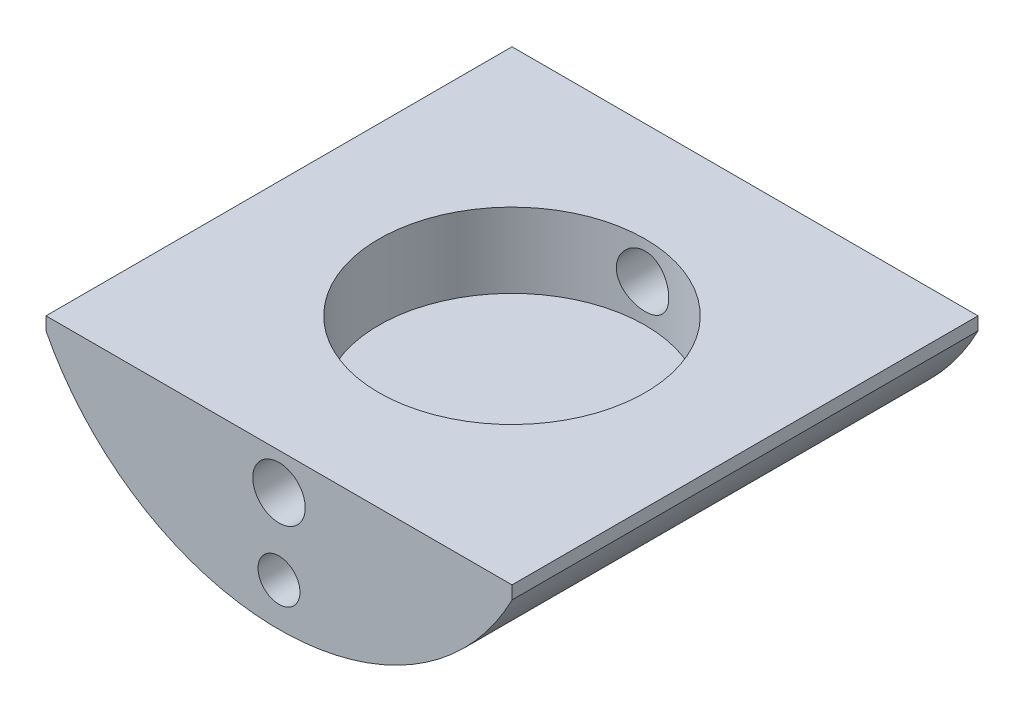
ISO-10303-21;
HEADER;
FILE_DESCRIPTION(('STEP AP214'),'2;1');
FILE_NAME('part.step','',(''),(''),'','','');
FILE_SCHEMA(('AUTOMOTIVE_DESIGN { 1 0 10303 214 1 1 1 1 }'));
ENDSEC;
DATA;
#1=APPLICATION_CONTEXT('core data for automotive mechanical design processes');
#2=APPLICATION_PROTOCOL_DEFINITION('international standard','automotive_design',2000,#1);
#3=PRODUCT_CONTEXT('',#1,'mechanical');
#4=PRODUCT('Part','Part','',(#3));
#5=PRODUCT_RELATED_PRODUCT_CATEGORY('part','',(#4));
#6=PRODUCT_DEFINITION_FORMATION('','',#4);
#7=PRODUCT_DEFINITION_CONTEXT('part definition',#1,'design');
#8=PRODUCT_DEFINITION('design','',#6,#7);
#9=PRODUCT_DEFINITION_SHAPE('','',#8);
#10=(LENGTH_UNIT() NAMED_UNIT(*) SI_UNIT(.MILLI.,.METRE.));
#11=(NAMED_UNIT(*) PLANE_ANGLE_UNIT() SI_UNIT($,.RADIAN.));
#12=(NAMED_UNIT(*) SI_UNIT($,.STERADIAN.) SOLID_ANGLE_UNIT());
#13=UNCERTAINTY_MEASURE_WITH_UNIT(LENGTH_MEASURE(1.E-05),#10,'distance_accuracy_value','');
#14=(GEOMETRIC_REPRESENTATION_CONTEXT(3) GLOBAL_UNCERTAINTY_ASSIGNED_CONTEXT((#13)) GLOBAL_UNIT_ASSIGNED_CONTEXT((#10,
#11,#12)) REPRESENTATION_CONTEXT('',''));
#15=CARTESIAN_POINT('',(0.,0.,0.));
#16=DIRECTION('',(0.,0.,1.));
#17=DIRECTION('',(1.,0.,0.));
#18=AXIS2_PLACEMENT_3D('',#15,#16,#17);
#19=CARTESIAN_POINT('',(0.,20.395359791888,44.45));
#20=DIRECTION('',(0.,0.,-1.));
#21=DIRECTION('',(-1.,0.,0.));
#22=AXIS2_PLACEMENT_3D('',#19,#20,#21);
#23=CYLINDRICAL_SURFACE('',#22,50.);
#24=CARTESIAN_POINT('',(0.,20.395359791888,-44.45));
#25=DIRECTION('',(0.,0.,1.));
#26=DIRECTION('',(1.,0.,0.));
#27=AXIS2_PLACEMENT_3D('',#24,#25,#26);
#28=CIRCLE('',#27,50.);
#29=CARTESIAN_POINT('',(-44.45,-2.5,-44.45));
#30=VERTEX_POINT('',#29);
#31=CARTESIAN_POINT('',(44.45,-2.5,-44.45));
#32=VERTEX_POINT('',#31);
#33=EDGE_CURVE('E116',#30,#32,#28,.T.);
#34=ORIENTED_EDGE('',*,*,#33,.T.);
#35=DIRECTION('',(0.,0.,-1.));
#36=VECTOR('',#35,1.);
#37=CARTESIAN_POINT('',(44.45,-2.5,44.45));
#38=LINE('',#37,#36);
#39=CARTESIAN_POINT('',(44.45,-2.5,44.45));
#40=VERTEX_POINT('',#39);
#41=EDGE_CURVE('E13',#40,#32,#38,.T.);
#42=ORIENTED_EDGE('',*,*,#41,.F.);
#43=CARTESIAN_POINT('',(0.,20.395359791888,44.45));
#44=DIRECTION('',(0.,0.,1.));
#45=DIRECTION('',(1.,0.,0.));
#46=AXIS2_PLACEMENT_3D('',#43,#44,#45);
#47=CIRCLE('',#46,50.);
#48=CARTESIAN_POINT('',(-44.45,-2.5,44.45));
#49=VERTEX_POINT('',#48);
#50=EDGE_CURVE('E103',#49,#40,#47,.T.);
#51=ORIENTED_EDGE('',*,*,#50,.F.);
#52=DIRECTION('',(0.,0.,-1.));
#53=VECTOR('',#52,1.);
#54=CARTESIAN_POINT('',(-44.45,-2.5,44.45));
#55=LINE('',#54,#53);
#56=EDGE_CURVE('E112',#49,#30,#55,.T.);
#57=ORIENTED_EDGE('',*,*,#56,.T.);
#58=EDGE_LOOP('',(#34,#42,#51,#57));
#59=FACE_BOUND('',#58,.T.);
#60=ADVANCED_FACE('F46',(#59),#23,.T.);
#61=CARTESIAN_POINT('',(44.45,0.,44.45));
#62=DIRECTION('',(-1.,0.,0.));
#63=DIRECTION('',(0.,-1.,0.));
#64=AXIS2_PLACEMENT_3D('',#61,#62,#63);
#65=PLANE('',#64);
#66=DIRECTION('',(0.,1.,0.));
#67=VECTOR('',#66,1.);
#68=CARTESIAN_POINT('',(44.45,0.,-44.45));
#69=LINE('',#68,#67);
#70=CARTESIAN_POINT('',(44.45,0.,-44.45));
#71=VERTEX_POINT('',#70);
#72=EDGE_CURVE('E107',#32,#71,#69,.T.);
#73=ORIENTED_EDGE('',*,*,#72,.T.);
#74=DIRECTION('',(0.,0.,-1.));
#75=VECTOR('',#74,1.);
#76=CARTESIAN_POINT('',(44.45,0.,44.45));
#77=LINE('',#76,#75);
#78=CARTESIAN_POINT('',(44.45,0.,44.45));
#79=VERTEX_POINT('',#78);
#80=EDGE_CURVE('E59',#79,#71,#77,.T.);
#81=ORIENTED_EDGE('',*,*,#80,.F.);
#82=DIRECTION('',(0.,1.,0.));
#83=VECTOR('',#82,1.);
#84=CARTESIAN_POINT('',(44.45,0.,44.45));
#85=LINE('',#84,#83);
#86=EDGE_CURVE('E98',#40,#79,#85,.T.);
#87=ORIENTED_EDGE('',*,*,#86,.F.);
#88=ORIENTED_EDGE('',*,*,#41,.T.);
#89=EDGE_LOOP('',(#73,#81,#87,#88));
#90=FACE_BOUND('',#89,.T.);
#91=ADVANCED_FACE('F106',(#90),#65,.F.);
#92=CARTESIAN_POINT('',(-44.45,0.,44.45));
#93=DIRECTION('',(0.,-1.,0.));
#94=DIRECTION('',(0.,0.,-1.));
#95=AXIS2_PLACEMENT_3D('',#92,#93,#94);
#96=PLANE('',#95);
#97=CARTESIAN_POINT('',(0.,0.,0.));
#98=DIRECTION('',(0.,1.,0.));
#99=DIRECTION('',(0.,0.,1.));
#100=AXIS2_PLACEMENT_3D('',#97,#98,#99);
#101=CIRCLE('',#100,25.4);
#102=CARTESIAN_POINT('',(0.,0.,25.4));
#103=VERTEX_POINT('',#102);
#104=EDGE_CURVE('E179',#103,#103,#101,.T.);
#105=ORIENTED_EDGE('',*,*,#104,.F.);
#106=EDGE_LOOP('',(#105));
#107=FACE_BOUND('',#106,.T.);
#108=DIRECTION('',(-1.,0.,0.));
#109=VECTOR('',#108,1.);
#110=CARTESIAN_POINT('',(-44.45,0.,-44.45));
#111=LINE('',#110,#109);
#112=CARTESIAN_POINT('',(-44.45,0.,-44.45));
#113=VERTEX_POINT('',#112);
#114=EDGE_CURVE('E85',#71,#113,#111,.T.);
#115=ORIENTED_EDGE('',*,*,#114,.T.);
#116=DIRECTION('',(0.,0.,-1.));
#117=VECTOR('',#116,1.);
#118=CARTESIAN_POINT('',(-44.45,0.,44.45));
#119=LINE('',#118,#117);
#120=CARTESIAN_POINT('',(-44.45,0.,44.45));
#121=VERTEX_POINT('',#120);
#122=EDGE_CURVE('E108',#121,#113,#119,.T.);
#123=ORIENTED_EDGE('',*,*,#122,.F.);
#124=DIRECTION('',(-1.,0.,0.));
#125=VECTOR('',#124,1.);
#126=CARTESIAN_POINT('',(-44.45,0.,44.45));
#127=LINE('',#126,#125);
#128=EDGE_CURVE('E101',#79,#121,#127,.T.);
#129=ORIENTED_EDGE('',*,*,#128,.F.);
#130=ORIENTED_EDGE('',*,*,#80,.T.);
#131=EDGE_LOOP('',(#115,#123,#129,#130));
#132=FACE_BOUND('',#131,.T.);
#133=ADVANCED_FACE('F110',(#107,#132),#96,.F.);
#134=CARTESIAN_POINT('',(-44.45,-2.5,44.45));
#135=DIRECTION('',(1.,0.,0.));
#136=DIRECTION('',(0.,1.,0.));
#137=AXIS2_PLACEMENT_3D('',#134,#135,#136);
#138=PLANE('',#137);
#139=DIRECTION('',(0.,-1.,0.));
#140=VECTOR('',#139,1.);
#141=CARTESIAN_POINT('',(-44.45,-2.5,-44.45));
#142=LINE('',#141,#140);
#143=EDGE_CURVE('E91',#113,#30,#142,.T.);
#144=ORIENTED_EDGE('',*,*,#143,.T.);
#145=ORIENTED_EDGE('',*,*,#56,.F.);
#146=DIRECTION('',(0.,-1.,0.));
#147=VECTOR('',#146,1.);
#148=CARTESIAN_POINT('',(-44.45,-2.5,44.45));
#149=LINE('',#148,#147);
#150=EDGE_CURVE('E68',#121,#49,#149,.T.);
#151=ORIENTED_EDGE('',*,*,#150,.F.);
#152=ORIENTED_EDGE('',*,*,#122,.T.);
#153=EDGE_LOOP('',(#144,#145,#151,#152));
#154=FACE_BOUND('',#153,.T.);
#155=ADVANCED_FACE('F166',(#154),#138,.F.);
#156=CARTESIAN_POINT('',(0.,20.395359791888,44.45));
#157=DIRECTION('',(0.,0.,1.));
#158=DIRECTION('',(1.,0.,0.));
#159=AXIS2_PLACEMENT_3D('',#156,#157,#158);
#160=PLANE('',#159);
#161=CARTESIAN_POINT('',(0.,-21.45,44.45));
#162=DIRECTION('',(0.,0.,1.));
#163=DIRECTION('',(1.,0.,0.));
#164=AXIS2_PLACEMENT_3D('',#161,#162,#163);
#165=CIRCLE('',#164,4.);
#166=CARTESIAN_POINT('',(4.,-21.45,44.45));
#167=VERTEX_POINT('',#166);
#168=EDGE_CURVE('E193',#167,#167,#165,.T.);
#169=ORIENTED_EDGE('',*,*,#168,.F.);
#170=EDGE_LOOP('',(#169));
#171=FACE_BOUND('',#170,.T.);
#172=CARTESIAN_POINT('',(0.,-7.00000000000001,44.45));
#173=DIRECTION('',(0.,0.,1.));
#174=DIRECTION('',(1.,0.,0.));
#175=AXIS2_PLACEMENT_3D('',#172,#173,#174);
#176=CIRCLE('',#175,4.99999999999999);
#177=CARTESIAN_POINT('',(4.99999999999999,-7.00000000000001,44.45));
#178=VERTEX_POINT('',#177);
#179=EDGE_CURVE('E187',#178,#178,#176,.T.);
#180=ORIENTED_EDGE('',*,*,#179,.F.);
#181=EDGE_LOOP('',(#180));
#182=FACE_BOUND('',#181,.T.);
#183=ORIENTED_EDGE('',*,*,#50,.T.);
#184=ORIENTED_EDGE('',*,*,#86,.T.);
#185=ORIENTED_EDGE('',*,*,#128,.T.);
#186=ORIENTED_EDGE('',*,*,#150,.T.);
#187=EDGE_LOOP('',(#183,#184,#185,#186));
#188=FACE_BOUND('',#187,.T.);
#189=ADVANCED_FACE('F99',(#171,#182,#188),#160,.T.);
#190=CARTESIAN_POINT('',(0.,20.395359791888,-44.45));
#191=DIRECTION('',(0.,0.,1.));
#192=DIRECTION('',(1.,0.,0.));
#193=AXIS2_PLACEMENT_3D('',#190,#191,#192);
#194=PLANE('',#193);
#195=CARTESIAN_POINT('',(0.,-21.45,-44.45));
#196=DIRECTION('',(0.,0.,-1.));
#197=DIRECTION('',(-1.,0.,0.));
#198=AXIS2_PLACEMENT_3D('',#195,#196,#197);
#199=CIRCLE('',#198,4.);
#200=CARTESIAN_POINT('',(-4.,-21.45,-44.45));
#201=VERTEX_POINT('',#200);
#202=EDGE_CURVE('E199',#201,#201,#199,.T.);
#203=ORIENTED_EDGE('',*,*,#202,.F.);
#204=EDGE_LOOP('',(#203));
#205=FACE_BOUND('',#204,.T.);
#206=CARTESIAN_POINT('',(0.,-7.00000000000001,-44.45));
#207=DIRECTION('',(0.,0.,1.));
#208=DIRECTION('',(1.,0.,0.));
#209=AXIS2_PLACEMENT_3D('',#206,#207,#208);
#210=CIRCLE('',#209,4.99999999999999);
#211=CARTESIAN_POINT('',(4.99999999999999,-7.00000000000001,-44.45));
#212=VERTEX_POINT('',#211);
#213=EDGE_CURVE('E128',#212,#212,#210,.T.);
#214=ORIENTED_EDGE('',*,*,#213,.T.);
#215=EDGE_LOOP('',(#214));
#216=FACE_BOUND('',#215,.T.);
#217=ORIENTED_EDGE('',*,*,#33,.F.);
#218=ORIENTED_EDGE('',*,*,#143,.F.);
#219=ORIENTED_EDGE('',*,*,#114,.F.);
#220=ORIENTED_EDGE('',*,*,#72,.F.);
#221=EDGE_LOOP('',(#217,#218,#219,#220));
#222=FACE_BOUND('',#221,.T.);
#223=ADVANCED_FACE('F150',(#205,#216,#222),#194,.F.);
#224=CARTESIAN_POINT('',(0.,-14.25,0.));
#225=DIRECTION('',(0.,1.,0.));
#226=DIRECTION('',(0.,0.,1.));
#227=AXIS2_PLACEMENT_3D('',#224,#225,#226);
#228=CYLINDRICAL_SURFACE('',#227,25.4);
#229=CARTESIAN_POINT('',(0.,-12.,25.4));
#230=CARTESIAN_POINT('',(0.139033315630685,-12.0000027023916,25.4000013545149));
#231=CARTESIAN_POINT('',(0.278032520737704,-11.9941993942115,25.398856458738));
#232=CARTESIAN_POINT('',(0.555072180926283,-11.9710370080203,25.3943117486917));
#233=CARTESIAN_POINT('',(0.693112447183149,-11.9536757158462,25.3909115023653));
#234=CARTESIAN_POINT('',(0.967264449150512,-11.9075183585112,25.381946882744));
#235=CARTESIAN_POINT('',(1.10337514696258,-11.8787163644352,25.3763813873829));
#236=CARTESIAN_POINT('',(1.37268381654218,-11.8098919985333,25.3632395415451));
#237=CARTESIAN_POINT('',(1.50588069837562,-11.7698655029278,25.3556624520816));
#238=CARTESIAN_POINT('',(1.76820160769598,-11.678964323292,25.338719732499));
#239=CARTESIAN_POINT('',(1.89733080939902,-11.6281041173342,25.3293564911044));
#240=CARTESIAN_POINT('',(2.15086295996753,-11.5158625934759,25.3090886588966));
#241=CARTESIAN_POINT('',(2.27526414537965,-11.4544773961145,25.2981835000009));
#242=CARTESIAN_POINT('',(2.51839552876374,-11.3216736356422,25.2751377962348));
#243=CARTESIAN_POINT('',(2.63712826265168,-11.2502596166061,25.2629978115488));
#244=CARTESIAN_POINT('',(2.86823690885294,-11.09785120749,25.2378037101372));
#245=CARTESIAN_POINT('',(2.98061042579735,-11.0168532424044,25.2247492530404));
#246=CARTESIAN_POINT('',(3.19945474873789,-10.8448766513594,25.197932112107));
#247=CARTESIAN_POINT('',(3.30584359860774,-10.7537947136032,25.1841630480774));
#248=CARTESIAN_POINT('',(3.51063434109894,-10.5630098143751,25.1564331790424));
#249=CARTESIAN_POINT('',(3.6090332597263,-10.4633036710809,25.1424723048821));
#250=CARTESIAN_POINT('',(3.79710730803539,-10.2560029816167,25.1147568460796));
#251=CARTESIAN_POINT('',(3.88678496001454,-10.1484107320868,25.1010022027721));
#252=CARTESIAN_POINT('',(4.05686336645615,-9.92599880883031,25.0740757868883));
#253=CARTESIAN_POINT('',(4.13726068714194,-9.81117648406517,25.060904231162));
#254=CARTESIAN_POINT('',(4.28881612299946,-9.57410259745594,25.0354152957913));
#255=CARTESIAN_POINT('',(4.35989048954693,-9.45179648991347,25.0231060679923));
#256=CARTESIAN_POINT('',(4.49148594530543,-9.20149645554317,24.9998200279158));
#257=CARTESIAN_POINT('',(4.55200307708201,-9.07350041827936,24.9888437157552));
#258=CARTESIAN_POINT('',(4.71691816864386,-8.68241179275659,24.9584323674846));
#259=CARTESIAN_POINT('',(4.8048626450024,-8.41193240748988,24.9414829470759));
#260=CARTESIAN_POINT('',(4.93287397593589,-7.86325890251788,24.9164801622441));
#261=CARTESIAN_POINT('',(4.97353519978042,-7.585206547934,24.9083164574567));
#262=CARTESIAN_POINT('',(5.00776395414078,-7.02607670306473,24.9014583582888));
#263=CARTESIAN_POINT('',(5.00133614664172,-6.74499951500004,24.902763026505));
#264=CARTESIAN_POINT('',(4.94202442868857,-6.1921758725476,24.9145992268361));
#265=CARTESIAN_POINT('',(4.88981944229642,-5.92035312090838,24.9249959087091));
#266=CARTESIAN_POINT('',(4.7415128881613,-5.38939827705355,24.9536311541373));
#267=CARTESIAN_POINT('',(4.64540928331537,-5.13026677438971,24.9718700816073));
#268=CARTESIAN_POINT('',(4.4113795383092,-4.63008941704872,25.0142737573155));
#269=CARTESIAN_POINT('',(4.27318302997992,-4.38917343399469,25.038476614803));
#270=CARTESIAN_POINT('',(3.95908171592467,-3.93369549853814,25.0900563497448));
#271=CARTESIAN_POINT('',(3.78317270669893,-3.7191364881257,25.1174335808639));
#272=CARTESIAN_POINT('',(3.39499848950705,-3.31854485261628,25.1728623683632));
#273=CARTESIAN_POINT('',(3.18215356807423,-3.13307399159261,25.2009173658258));
#274=CARTESIAN_POINT('',(2.72807934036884,-2.80038108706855,25.2541036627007));
#275=CARTESIAN_POINT('',(2.48684969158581,-2.65315950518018,25.2792349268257));
#276=CARTESIAN_POINT('',(1.98223942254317,-2.40104580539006,25.323800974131));
#277=CARTESIAN_POINT('',(1.7188266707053,-2.29621641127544,25.3432273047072));
#278=CARTESIAN_POINT('',(1.17766174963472,-2.13245375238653,25.3741302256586));
#279=CARTESIAN_POINT('',(0.899911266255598,-2.07351510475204,25.3856077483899));
#280=CARTESIAN_POINT('',(0.342784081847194,-2.00399885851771,25.3991904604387));
#281=CARTESIAN_POINT('',(0.0635068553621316,-1.99265224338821,25.4014446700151));
#282=CARTESIAN_POINT('',(-0.492953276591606,-2.01657322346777,25.3967400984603));
#283=CARTESIAN_POINT('',(-0.770136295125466,-2.05183828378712,25.3897818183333));
#284=CARTESIAN_POINT('',(-1.31206964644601,-2.16734252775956,25.3675272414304));
#285=CARTESIAN_POINT('',(-1.57690703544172,-2.24718853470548,25.3523038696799));
#286=CARTESIAN_POINT('',(-2.08943483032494,-2.44915963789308,25.3152196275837));
#287=CARTESIAN_POINT('',(-2.33712398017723,-2.57128782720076,25.2933582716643));
#288=CARTESIAN_POINT('',(-2.8115775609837,-2.85602979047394,25.245051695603));
#289=CARTESIAN_POINT('',(-3.03805770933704,-3.01910833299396,25.2185549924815));
#290=CARTESIAN_POINT('',(-3.46071358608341,-3.38049880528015,25.1640409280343));
#291=CARTESIAN_POINT('',(-3.6568861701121,-3.57881438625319,25.1360234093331));
#292=CARTESIAN_POINT('',(-4.01631482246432,-4.00854161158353,25.0811250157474));
#293=CARTESIAN_POINT('',(-4.17904374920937,-4.24039753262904,25.0542669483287));
#294=CARTESIAN_POINT('',(-4.46324627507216,-4.72861616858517,25.005205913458));
#295=CARTESIAN_POINT('',(-4.58472149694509,-4.98497791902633,24.9830027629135));
#296=CARTESIAN_POINT('',(-4.78224582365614,-5.51360452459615,24.9459459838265));
#297=CARTESIAN_POINT('',(-4.85852647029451,-5.78578033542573,24.93105496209));
#298=CARTESIAN_POINT('',(-4.96418579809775,-6.33956670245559,24.9102363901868));
#299=CARTESIAN_POINT('',(-4.99357038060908,-6.62117606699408,24.904307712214));
#300=CARTESIAN_POINT('',(-5.00175701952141,-7.04153403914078,24.902656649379));
#301=CARTESIAN_POINT('',(-4.99867696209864,-7.1801476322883,24.9032784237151));
#302=CARTESIAN_POINT('',(-4.98103019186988,-7.45659811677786,24.906815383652));
#303=CARTESIAN_POINT('',(-4.96646783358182,-7.5944352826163,24.9097296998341));
#304=CARTESIAN_POINT('',(-4.92595929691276,-7.86839945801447,24.9177715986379));
#305=CARTESIAN_POINT('',(-4.90000912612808,-8.00452585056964,24.9228999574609));
#306=CARTESIAN_POINT('',(-4.83694216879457,-8.27402181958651,24.9352165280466));
#307=CARTESIAN_POINT('',(-4.79982936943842,-8.40739236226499,24.9424040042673));
#308=CARTESIAN_POINT('',(-4.71480032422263,-8.67024014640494,24.9586162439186));
#309=CARTESIAN_POINT('',(-4.66690515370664,-8.79972443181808,24.9676374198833));
#310=CARTESIAN_POINT('',(-4.56064602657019,-9.0541436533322,24.9872652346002));
#311=CARTESIAN_POINT('',(-4.50228577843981,-9.17908018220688,24.9978713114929));
#312=CARTESIAN_POINT('',(-4.37547907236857,-9.42366804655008,25.0203782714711));
#313=CARTESIAN_POINT('',(-4.30702845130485,-9.54331717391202,25.03227968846));
#314=CARTESIAN_POINT('',(-4.16056336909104,-9.77644680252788,25.0570394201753));
#315=CARTESIAN_POINT('',(-4.08255219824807,-9.88992940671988,25.0698974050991));
#316=CARTESIAN_POINT('',(-3.91608555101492,-10.1118869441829,25.0964438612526));
#317=CARTESIAN_POINT('',(-3.82747628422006,-10.2202453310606,25.1101426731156));
#318=CARTESIAN_POINT('',(-3.64153949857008,-10.4291007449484,25.1377806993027));
#319=CARTESIAN_POINT('',(-3.5442150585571,-10.5296005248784,25.1517198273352));
#320=CARTESIAN_POINT('',(-3.34141869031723,-10.7221611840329,25.179463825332));
#321=CARTESIAN_POINT('',(-3.23594196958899,-10.8142170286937,25.1932686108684));
#322=CARTESIAN_POINT('',(-3.01764152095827,-10.9891600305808,25.2203475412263));
#323=CARTESIAN_POINT('',(-2.90482051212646,-11.0720505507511,25.2336218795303));
#324=CARTESIAN_POINT('',(-2.67133574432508,-11.2289423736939,25.2594121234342));
#325=CARTESIAN_POINT('',(-2.55060216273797,-11.3028413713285,25.2719186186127));
#326=CARTESIAN_POINT('',(-2.30325523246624,-11.4401597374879,25.2956606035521));
#327=CARTESIAN_POINT('',(-2.17664406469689,-11.5035829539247,25.3068965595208));
#328=CARTESIAN_POINT('',(-1.91846293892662,-11.6194701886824,25.3277763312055));
#329=CARTESIAN_POINT('',(-1.78689608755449,-11.67194094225,25.3374211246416));
#330=CARTESIAN_POINT('',(-1.51971834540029,-11.7655534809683,25.3548494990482));
#331=CARTESIAN_POINT('',(-1.38410824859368,-11.8066974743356,25.3626334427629));
#332=CARTESIAN_POINT('',(-1.04370876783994,-11.8943501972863,25.3793611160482));
#333=CARTESIAN_POINT('',(-0.837027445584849,-11.9339155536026,25.3870609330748));
#334=CARTESIAN_POINT('',(-0.420204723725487,-11.9867380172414,25.3973792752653));
#335=CARTESIAN_POINT('',(-0.210063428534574,-11.9999959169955,25.399997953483));
#336=CARTESIAN_POINT('',(0.,-12.,25.4));
#337=B_SPLINE_CURVE_WITH_KNOTS('',3,(#229,#230,#231,#232,#233,#234,#235,#236,#237,#238,#239,
#240,#241,#242,#243,#244,#245,#246,#247,#248,#249,#250,#251,#252,#253,#254,#255,#256,#257,#258,
#259,#260,#261,#262,#263,#264,#265,#266,#267,#268,#269,#270,#271,#272,#273,#274,#275,#276,#277,
#278,#279,#280,#281,#282,#283,#284,#285,#286,#287,#288,#289,#290,#291,#292,#293,#294,#295,#296,
#297,#298,#299,#300,#301,#302,#303,#304,#305,#306,#307,#308,#309,#310,#311,#312,#313,#314,#315,
#316,#317,#318,#319,#320,#321,#322,#323,#324,#325,#326,#327,#328,#329,#330,#331,#332,#333,#334,
#335,#336),.UNSPECIFIED.,.T.,.F.,(4,2,2,2,2,2,2,2,2,2,2,2,2,2,2,2,2,2,2,2,2,2,2,2,2,2,2,2,2,2,2,
2,2,2,2,2,2,2,2,2,2,2,2,2,2,2,2,2,2,2,2,2,2,4),(0.,0.416915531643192,0.833910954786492,
1.25112275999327,1.6684880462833,2.08529903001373,2.50226397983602,2.9190406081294,
3.3359731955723,3.75766182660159,4.17950670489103,4.60122921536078,5.02310726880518,
5.44854767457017,5.87414721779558,6.72433593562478,7.56371779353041,8.40301655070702,
9.23007423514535,10.0571703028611,10.889695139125,11.7223128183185,12.5694283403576,
13.4165540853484,14.2649286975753,15.1132037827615,15.9477179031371,16.7821866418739,
17.609409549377,18.4366929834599,19.2738273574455,20.1110485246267,20.9605958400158,
21.8101097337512,22.6552328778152,23.5002496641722,23.9157913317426,24.3311754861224,
24.7467053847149,25.1620870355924,25.5766637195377,25.9910937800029,26.4056953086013,
26.8201545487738,27.2415949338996,27.6628870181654,28.0844286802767,28.5058151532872,
28.9316194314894,29.3572669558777,29.782651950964,30.2079539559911,30.8378845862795,
31.4677962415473),.UNSPECIFIED.);
#338=CARTESIAN_POINT('',(0.,-12.,25.4));
#339=VERTEX_POINT('',#338);
#340=EDGE_CURVE('E49',#339,#339,#337,.T.);
#341=ORIENTED_EDGE('',*,*,#340,.T.);
#342=EDGE_LOOP('',(#341));
#343=FACE_BOUND('',#342,.T.);
#344=CARTESIAN_POINT('',(4.99999999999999,-7.00000000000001,-24.9030118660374));
#345=CARTESIAN_POINT('',(5.00000271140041,-7.13900396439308,-24.9030104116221));
#346=CARTESIAN_POINT('',(4.99420182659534,-7.27797380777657,-24.9041778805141));
#347=CARTESIAN_POINT('',(4.97104936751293,-7.5549539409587,-24.9088100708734));
#348=CARTESIAN_POINT('',(4.95369557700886,-7.69296404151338,-24.9122752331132));
#349=CARTESIAN_POINT('',(4.90755872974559,-7.96705508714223,-24.9214047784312));
#350=CARTESIAN_POINT('',(4.87876969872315,-8.10313498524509,-24.9270703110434));
#351=CARTESIAN_POINT('',(4.80997731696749,-8.37238137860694,-24.9404359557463));
#352=CARTESIAN_POINT('',(4.76996983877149,-8.50554678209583,-24.9481368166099));
#353=CARTESIAN_POINT('',(4.6791145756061,-8.76780070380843,-24.9653363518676));
#354=CARTESIAN_POINT('',(4.62828164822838,-8.8968945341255,-24.9748325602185));
#355=CARTESIAN_POINT('',(4.5161013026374,-9.15035891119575,-24.9953611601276));
#356=CARTESIAN_POINT('',(4.45475000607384,-9.27472769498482,-25.0063941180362));
#357=CARTESIAN_POINT('',(4.32201926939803,-9.51779993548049,-25.0296760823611));
#358=CARTESIAN_POINT('',(4.25064433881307,-9.63650590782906,-25.0419245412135));
#359=CARTESIAN_POINT('',(4.09831775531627,-9.8675682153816,-25.0673044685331));
#360=CARTESIAN_POINT('',(4.01736252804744,-9.97992215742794,-25.0804362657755));
#361=CARTESIAN_POINT('',(3.84542905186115,-10.1987922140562,-25.1073760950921));
#362=CARTESIAN_POINT('',(3.75434277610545,-10.3052227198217,-25.1211903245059));
#363=CARTESIAN_POINT('',(3.56354038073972,-10.510097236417,-25.1489656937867));
#364=CARTESIAN_POINT('',(3.4638210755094,-10.6085382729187,-25.1629268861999));
#365=CARTESIAN_POINT('',(3.25648565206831,-10.7966948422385,-25.1905980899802));
#366=CARTESIAN_POINT('',(3.14887188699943,-10.8864129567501,-25.2043081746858));
#367=CARTESIAN_POINT('',(2.92640856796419,-11.0565693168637,-25.2311056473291));
#368=CARTESIAN_POINT('',(2.81155636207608,-11.1370041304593,-25.2441928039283));
#369=CARTESIAN_POINT('',(2.5744579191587,-11.2886027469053,-25.269477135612));
#370=CARTESIAN_POINT('',(2.4521594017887,-11.3596863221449,-25.2816662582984));
#371=CARTESIAN_POINT('',(2.20187363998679,-11.4913009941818,-25.3046953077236));
#372=CARTESIAN_POINT('',(2.07388428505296,-11.5518281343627,-25.3155347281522));
#373=CARTESIAN_POINT('',(1.68281578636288,-11.7167737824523,-25.3455340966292));
#374=CARTESIAN_POINT('',(1.41235102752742,-11.8047386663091,-25.362206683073));
#375=CARTESIAN_POINT('',(0.863734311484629,-11.93278902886,-25.3867779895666));
#376=CARTESIAN_POINT('',(0.585724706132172,-11.9734718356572,-25.3947860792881));
#377=CARTESIAN_POINT('',(0.0266794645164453,-12.0077586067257,-25.4015224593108));
#378=CARTESIAN_POINT('',(-0.254355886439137,-12.0013669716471,-25.4002516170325));
#379=CARTESIAN_POINT('',(-0.807332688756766,-11.9421148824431,-25.3886529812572));
#380=CARTESIAN_POINT('',(-1.07934611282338,-11.8898968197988,-25.3784503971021));
#381=CARTESIAN_POINT('',(-1.61067544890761,-11.7414989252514,-25.3502770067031));
#382=CARTESIAN_POINT('',(-1.86999086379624,-11.6453173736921,-25.3323058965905));
#383=CARTESIAN_POINT('',(-2.37040021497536,-11.4111215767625,-25.2904072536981));
#384=CARTESIAN_POINT('',(-2.61137263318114,-11.2728543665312,-25.266443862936));
#385=CARTESIAN_POINT('',(-3.0669339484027,-10.9585995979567,-25.215204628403));
#386=CARTESIAN_POINT('',(-3.28151989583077,-10.782607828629,-25.1879284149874));
#387=CARTESIAN_POINT('',(-3.6820269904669,-10.3943717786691,-25.1325349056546));
#388=CARTESIAN_POINT('',(-3.86740278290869,-10.1815654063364,-25.1044111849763));
#389=CARTESIAN_POINT('',(-4.19992181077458,-9.72760322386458,-25.0509302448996));
#390=CARTESIAN_POINT('',(-4.34706436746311,-9.48644691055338,-25.025573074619));
#391=CARTESIAN_POINT('',(-4.59911971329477,-8.9818626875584,-24.9804844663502));
#392=CARTESIAN_POINT('',(-4.70394655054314,-8.7183907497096,-24.9607645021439));
#393=CARTESIAN_POINT('',(-4.86768626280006,-8.17709630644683,-24.929353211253));
#394=CARTESIAN_POINT('',(-4.92660491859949,-7.89927561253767,-24.9176608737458));
#395=CARTESIAN_POINT('',(-4.99604557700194,-7.34210627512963,-24.9038305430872));
#396=CARTESIAN_POINT('',(-5.00735407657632,-7.06285940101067,-24.9015372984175));
#397=CARTESIAN_POINT('',(-4.98336771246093,-6.50646887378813,-24.9063484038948));
#398=CARTESIAN_POINT('',(-4.94807540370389,-6.2293251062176,-24.9134522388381));
#399=CARTESIAN_POINT('',(-4.83256657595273,-5.68763654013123,-24.9361118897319));
#400=CARTESIAN_POINT('',(-4.7527682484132,-5.42299897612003,-24.9515889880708));
#401=CARTESIAN_POINT('',(-4.55095875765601,-4.91084993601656,-24.9891825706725));
#402=CARTESIAN_POINT('',(-4.42894421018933,-4.66333983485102,-25.0112995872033));
#403=CARTESIAN_POINT('',(-4.14437805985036,-4.18902406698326,-25.0600309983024));
#404=CARTESIAN_POINT('',(-3.98133311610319,-3.96251997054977,-25.086698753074));
#405=CARTESIAN_POINT('',(-3.61999299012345,-3.5398003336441,-25.1413794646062));
#406=CARTESIAN_POINT('',(-3.42169429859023,-3.34358781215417,-25.1693925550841));
#407=CARTESIAN_POINT('',(-2.99195334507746,-2.98405005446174,-25.2241103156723));
#408=CARTESIAN_POINT('',(-2.76006304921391,-2.82125586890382,-25.2507894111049));
#409=CARTESIAN_POINT('',(-2.27175605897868,-2.53693896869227,-25.2993915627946));
#410=CARTESIAN_POINT('',(-2.01534037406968,-2.41541455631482,-25.3213148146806));
#411=CARTESIAN_POINT('',(-1.48672954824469,-2.21786198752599,-25.3578279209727));
#412=CARTESIAN_POINT('',(-1.2146314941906,-2.14158125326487,-25.3724584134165));
#413=CARTESIAN_POINT('',(-0.661011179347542,-2.03589541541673,-25.3929034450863));
#414=CARTESIAN_POINT('',(-0.379490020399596,-2.0064848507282,-25.398719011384));
#415=CARTESIAN_POINT('',(0.0408395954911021,-1.9982357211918,-25.4003495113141));
#416=CARTESIAN_POINT('',(0.179510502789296,-2.00129853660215,-25.3997435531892));
#417=CARTESIAN_POINT('',(0.456077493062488,-2.01892050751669,-25.3962801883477));
#418=CARTESIAN_POINT('',(0.59397384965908,-2.03347530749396,-25.3934236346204));
#419=CARTESIAN_POINT('',(0.868057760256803,-2.07397883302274,-25.3855332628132));
#420=CARTESIAN_POINT('',(1.00424470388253,-2.09993151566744,-25.3804986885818));
#421=CARTESIAN_POINT('',(1.2738625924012,-2.16301414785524,-25.3683951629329));
#422=CARTESIAN_POINT('',(1.40729450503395,-2.20014009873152,-25.3613269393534));
#423=CARTESIAN_POINT('',(1.67028217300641,-2.28521214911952,-25.3453641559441));
#424=CARTESIAN_POINT('',(1.79984447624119,-2.33313864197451,-25.3364729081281));
#425=CARTESIAN_POINT('',(2.05441509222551,-2.43947368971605,-25.3171023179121));
#426=CARTESIAN_POINT('',(2.17942500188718,-2.49787852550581,-25.3066235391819));
#427=CARTESIAN_POINT('',(2.42415165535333,-2.62478617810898,-25.2843547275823));
#428=CARTESIAN_POINT('',(2.5438662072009,-2.69329312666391,-25.2725641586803));
#429=CARTESIAN_POINT('',(2.77711628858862,-2.83988070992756,-25.2479974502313));
#430=CARTESIAN_POINT('',(2.89065392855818,-2.91795804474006,-25.2352216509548));
#431=CARTESIAN_POINT('',(3.11262121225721,-3.08449905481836,-25.2088135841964));
#432=CARTESIAN_POINT('',(3.22093972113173,-3.17310923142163,-25.195170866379));
#433=CARTESIAN_POINT('',(3.42971425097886,-3.35903955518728,-25.1676011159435));
#434=CARTESIAN_POINT('',(3.53017302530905,-3.45635662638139,-25.1536741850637));
#435=CARTESIAN_POINT('',(3.72265230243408,-3.65912997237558,-25.1259093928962));
#436=CARTESIAN_POINT('',(3.81466772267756,-3.76459108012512,-25.1120715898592));
#437=CARTESIAN_POINT('',(3.98953185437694,-3.98285192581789,-25.0848851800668));
#438=CARTESIAN_POINT('',(4.07238392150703,-4.09564895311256,-25.0715363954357));
#439=CARTESIAN_POINT('',(4.22922519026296,-4.32911218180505,-25.0455593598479));
#440=CARTESIAN_POINT('',(4.30310927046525,-4.44985008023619,-25.0329404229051));
#441=CARTESIAN_POINT('',(4.44039758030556,-4.69720360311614,-25.0089529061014));
#442=CARTESIAN_POINT('',(4.5038056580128,-4.82381704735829,-24.9975838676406));
#443=CARTESIAN_POINT('',(4.61966301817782,-5.08200179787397,-24.976432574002));
#444=CARTESIAN_POINT('',(4.67211908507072,-5.2135699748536,-24.9666493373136));
#445=CARTESIAN_POINT('',(4.76570313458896,-5.48075131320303,-24.9489545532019));
#446=CARTESIAN_POINT('',(4.80683333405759,-5.61636367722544,-24.9410426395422));
#447=CARTESIAN_POINT('',(4.8944309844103,-5.95668756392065,-24.924033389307));
#448=CARTESIAN_POINT('',(4.93396584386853,-6.16328924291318,-24.9161933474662));
#449=CARTESIAN_POINT('',(4.98674787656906,-6.57995331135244,-24.9056837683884));
#450=CARTESIAN_POINT('',(4.99999590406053,-6.79001558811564,-24.9030140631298));
#451=CARTESIAN_POINT('',(4.99999999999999,-7.00000000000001,-24.9030118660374));
#452=B_SPLINE_CURVE_WITH_KNOTS('',3,(#344,#345,#346,#347,#348,#349,#350,#351,#352,#353,#354,
#355,#356,#357,#358,#359,#360,#361,#362,#363,#364,#365,#366,#367,#368,#369,#370,#371,#372,#373,
#374,#375,#376,#377,#378,#379,#380,#381,#382,#383,#384,#385,#386,#387,#388,#389,#390,#391,#392,
#393,#394,#395,#396,#397,#398,#399,#400,#401,#402,#403,#404,#405,#406,#407,#408,#409,#410,#411,
#412,#413,#414,#415,#416,#417,#418,#419,#420,#421,#422,#423,#424,#425,#426,#427,#428,#429,#430,
#431,#432,#433,#434,#435,#436,#437,#438,#439,#440,#441,#442,#443,#444,#445,#446,#447,#448,#449,
#450,#451),.UNSPECIFIED.,.T.,.F.,(4,2,2,2,2,2,2,2,2,2,2,2,2,2,2,2,2,2,2,2,2,2,2,2,2,2,2,2,2,2,2,
2,2,2,2,2,2,2,2,2,2,2,2,2,2,2,2,2,2,2,2,2,2,4),(0.,0.416827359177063,0.833734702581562,
1.25086014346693,1.66813925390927,2.08484931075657,2.5017133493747,2.91839044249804,
3.33522348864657,3.75702802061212,4.17898886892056,4.60082444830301,5.02281548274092,
5.4482188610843,5.8737813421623,6.72389986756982,7.56315767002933,8.40233701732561,
9.22993740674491,10.0575701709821,10.8902792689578,11.7230813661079,12.5699492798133,
13.416832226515,14.2654268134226,15.1139145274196,15.948329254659,16.7826982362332,
17.6093562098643,18.4360804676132,19.273264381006,20.1105316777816,20.9602195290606,
21.8098724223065,22.654736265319,23.4995016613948,23.9152139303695,24.3307687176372,
24.7464678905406,25.1620184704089,25.5768206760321,25.9914759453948,26.4063012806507,
26.8209839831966,27.2423177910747,27.6635033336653,28.0849407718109,28.506223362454,
28.9320454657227,29.3577108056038,29.7831116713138,30.2084292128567,30.8381241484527,
31.4677986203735),.UNSPECIFIED.);
#453=CARTESIAN_POINT('',(4.99999999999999,-7.00000000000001,-24.9030118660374));
#454=VERTEX_POINT('',#453);
#455=EDGE_CURVE('E124',#454,#454,#452,.T.);
#456=ORIENTED_EDGE('',*,*,#455,.T.);
#457=EDGE_LOOP('',(#456));
#458=FACE_BOUND('',#457,.T.);
#459=CARTESIAN_POINT('',(0.,-14.25,0.));
#460=DIRECTION('',(0.,1.,0.));
#461=DIRECTION('',(0.,0.,1.));
#462=AXIS2_PLACEMENT_3D('',#459,#460,#461);
#463=CIRCLE('',#462,25.4);
#464=CARTESIAN_POINT('',(0.,-14.25,25.4));
#465=VERTEX_POINT('',#464);
#466=EDGE_CURVE('E119',#465,#465,#463,.T.);
#467=ORIENTED_EDGE('',*,*,#466,.F.);
#468=EDGE_LOOP('',(#467));
#469=FACE_BOUND('',#468,.T.);
#470=ORIENTED_EDGE('',*,*,#104,.T.);
#471=EDGE_LOOP('',(#470));
#472=FACE_BOUND('',#471,.T.);
#473=ADVANCED_FACE('F129',(#343,#458,#469,#472),#228,.F.);
#474=CARTESIAN_POINT('',(0.,-14.25,0.));
#475=DIRECTION('',(0.,1.,0.));
#476=DIRECTION('',(0.,0.,1.));
#477=AXIS2_PLACEMENT_3D('',#474,#475,#476);
#478=PLANE('',#477);
#479=ORIENTED_EDGE('',*,*,#466,.T.);
#480=EDGE_LOOP('',(#479));
#481=FACE_BOUND('',#480,.T.);
#482=ADVANCED_FACE('F141',(#481),#478,.T.);
#483=CARTESIAN_POINT('',(0.,-7.00000000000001,44.45));
#484=DIRECTION('',(0.,0.,1.));
#485=DIRECTION('',(1.,0.,0.));
#486=AXIS2_PLACEMENT_3D('',#483,#484,#485);
#487=CYLINDRICAL_SURFACE('',#486,4.99999999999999);
#488=ORIENTED_EDGE('',*,*,#213,.F.);
#489=EDGE_LOOP('',(#488));
#490=FACE_BOUND('',#489,.T.);
#491=ORIENTED_EDGE('',*,*,#455,.F.);
#492=EDGE_LOOP('',(#491));
#493=FACE_BOUND('',#492,.T.);
#494=ADVANCED_FACE('F138',(#490,#493),#487,.F.);
#495=ORIENTED_EDGE('',*,*,#179,.T.);
#496=EDGE_LOOP('',(#495));
#497=FACE_BOUND('',#496,.T.);
#498=ORIENTED_EDGE('',*,*,#340,.F.);
#499=EDGE_LOOP('',(#498));
#500=FACE_BOUND('',#499,.T.);
#501=ADVANCED_FACE('F133',(#497,#500),#487,.F.);
#502=CARTESIAN_POINT('',(0.,-21.45,26.95));
#503=DIRECTION('',(0.,0.,-1.));
#504=DIRECTION('',(-1.,0.,0.));
#505=AXIS2_PLACEMENT_3D('',#502,#503,#504);
#506=PLANE('',#505);
#507=CARTESIAN_POINT('',(0.,-21.45,26.95));
#508=DIRECTION('',(0.,0.,1.));
#509=DIRECTION('',(1.,0.,0.));
#510=AXIS2_PLACEMENT_3D('',#507,#508,#509);
#511=CIRCLE('',#510,3.99999999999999);
#512=CARTESIAN_POINT('',(3.99999999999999,-21.45,26.95));
#513=VERTEX_POINT('',#512);
#514=EDGE_CURVE('E190',#513,#513,#511,.T.);
#515=ORIENTED_EDGE('',*,*,#514,.T.);
#516=EDGE_LOOP('',(#515));
#517=FACE_BOUND('',#516,.T.);
#518=ADVANCED_FACE('F137',(#517),#506,.F.);
#519=CARTESIAN_POINT('',(0.,-21.45,44.45));
#520=DIRECTION('',(0.,0.,1.));
#521=DIRECTION('',(1.,0.,0.));
#522=AXIS2_PLACEMENT_3D('',#519,#520,#521);
#523=CYLINDRICAL_SURFACE('',#522,4.);
#524=ORIENTED_EDGE('',*,*,#514,.F.);
#525=EDGE_LOOP('',(#524));
#526=FACE_BOUND('',#525,.T.);
#527=ORIENTED_EDGE('',*,*,#168,.T.);
#528=EDGE_LOOP('',(#527));
#529=FACE_BOUND('',#528,.T.);
#530=ADVANCED_FACE('F210',(#526,#529),#523,.F.);
#531=CARTESIAN_POINT('',(0.,-21.45,-26.95));
#532=DIRECTION('',(0.,0.,1.));
#533=DIRECTION('',(1.,0.,0.));
#534=AXIS2_PLACEMENT_3D('',#531,#532,#533);
#535=PLANE('',#534);
#536=CARTESIAN_POINT('',(0.,-21.45,-26.95));
#537=DIRECTION('',(0.,0.,-1.));
#538=DIRECTION('',(-1.,0.,0.));
#539=AXIS2_PLACEMENT_3D('',#536,#537,#538);
#540=CIRCLE('',#539,3.99999999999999);
#541=CARTESIAN_POINT('',(-3.99999999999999,-21.45,-26.95));
#542=VERTEX_POINT('',#541);
#543=EDGE_CURVE('E196',#542,#542,#540,.T.);
#544=ORIENTED_EDGE('',*,*,#543,.T.);
#545=EDGE_LOOP('',(#544));
#546=FACE_BOUND('',#545,.T.);
#547=ADVANCED_FACE('F204',(#546),#535,.F.);
#548=CARTESIAN_POINT('',(0.,-21.45,-44.45));
#549=DIRECTION('',(0.,0.,-1.));
#550=DIRECTION('',(-1.,0.,0.));
#551=AXIS2_PLACEMENT_3D('',#548,#549,#550);
#552=CYLINDRICAL_SURFACE('',#551,4.);
#553=ORIENTED_EDGE('',*,*,#543,.F.);
#554=EDGE_LOOP('',(#553));
#555=FACE_BOUND('',#554,.T.);
#556=ORIENTED_EDGE('',*,*,#202,.T.);
#557=EDGE_LOOP('',(#556));
#558=FACE_BOUND('',#557,.T.);
#559=ADVANCED_FACE('F202',(#555,#558),#552,.F.);
#560=CLOSED_SHELL('',(#60,#91,#133,#155,#189,#223,#473,#482,#494,#501,#518,#530,#547,#559));
#561=MANIFOLD_SOLID_BREP('B2',#560);
#562=ADVANCED_BREP_SHAPE_REPRESENTATION('',(#18,#561),#14);
#563=SHAPE_DEFINITION_REPRESENTATION(#9,#562);
ENDSEC;
END-ISO-10303-21;
